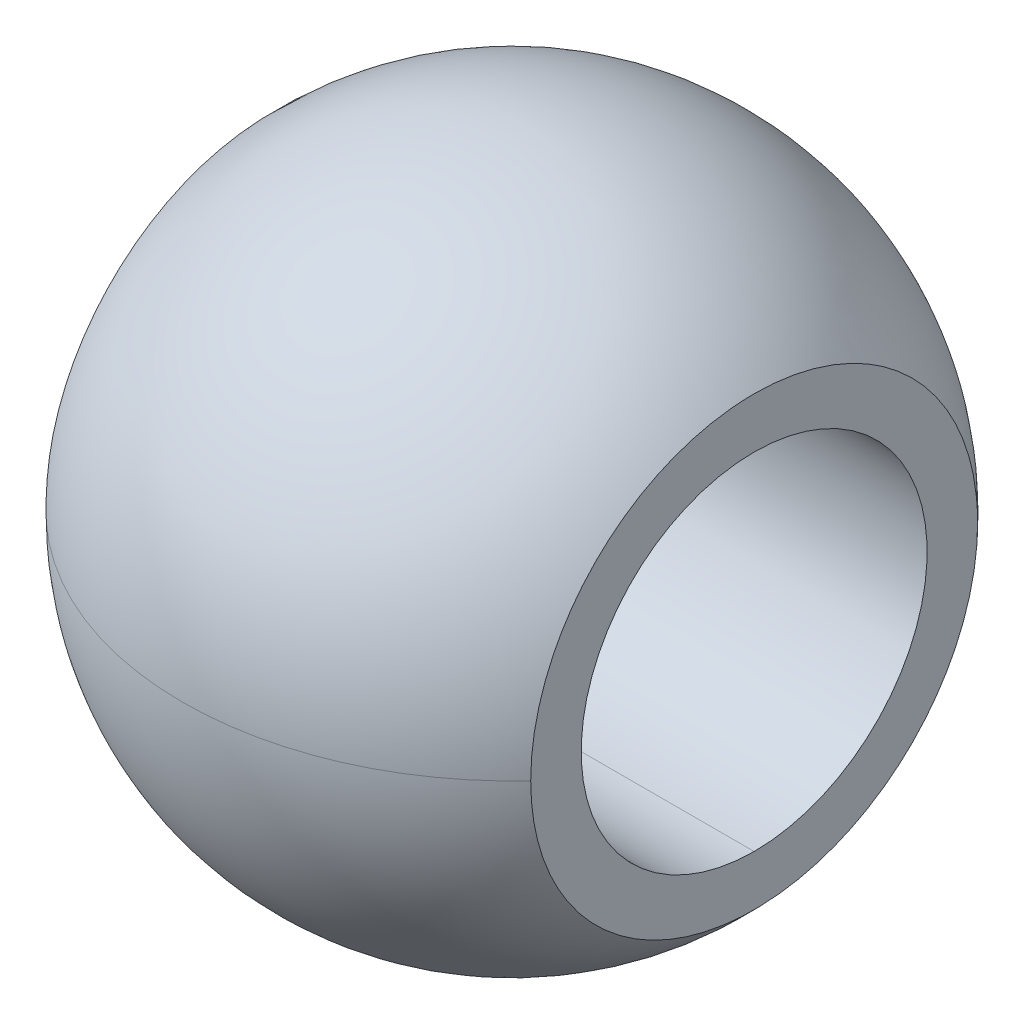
ISO-10303-21;
HEADER;
FILE_DESCRIPTION(('STEP AP214'),'2;1');
FILE_NAME('part.step','',(''),(''),'','','');
FILE_SCHEMA(('AUTOMOTIVE_DESIGN { 1 0 10303 214 1 1 1 1 }'));
ENDSEC;
DATA;
#1=APPLICATION_CONTEXT('core data for automotive mechanical design processes');
#2=APPLICATION_PROTOCOL_DEFINITION('international standard','automotive_design',2000,#1);
#3=PRODUCT_CONTEXT('',#1,'mechanical');
#4=PRODUCT('Part','Part','',(#3));
#5=PRODUCT_RELATED_PRODUCT_CATEGORY('part','',(#4));
#6=PRODUCT_DEFINITION_FORMATION('','',#4);
#7=PRODUCT_DEFINITION_CONTEXT('part definition',#1,'design');
#8=PRODUCT_DEFINITION('design','',#6,#7);
#9=PRODUCT_DEFINITION_SHAPE('','',#8);
#10=(LENGTH_UNIT() NAMED_UNIT(*) SI_UNIT(.MILLI.,.METRE.));
#11=(NAMED_UNIT(*) PLANE_ANGLE_UNIT() SI_UNIT($,.RADIAN.));
#12=(NAMED_UNIT(*) SI_UNIT($,.STERADIAN.) SOLID_ANGLE_UNIT());
#13=UNCERTAINTY_MEASURE_WITH_UNIT(LENGTH_MEASURE(1.E-05),#10,'distance_accuracy_value','');
#14=(GEOMETRIC_REPRESENTATION_CONTEXT(3) GLOBAL_UNCERTAINTY_ASSIGNED_CONTEXT((#13)) GLOBAL_UNIT_ASSIGNED_CONTEXT((#10,
#11,#12)) REPRESENTATION_CONTEXT('',''));
#15=CARTESIAN_POINT('',(0.,0.,0.));
#16=DIRECTION('',(0.,0.,1.));
#17=DIRECTION('',(1.,0.,0.));
#18=AXIS2_PLACEMENT_3D('',#15,#16,#17);
#19=CARTESIAN_POINT('',(0.,0.,0.));
#20=DIRECTION('',(-1.,0.,0.));
#21=DIRECTION('',(0.,0.,1.));
#22=AXIS2_PLACEMENT_3D('',#19,#20,#21);
#23=CYLINDRICAL_SURFACE('',#22,5.);
#24=CARTESIAN_POINT('',(-7.,0.,0.));
#25=DIRECTION('',(-1.,0.,0.));
#26=DIRECTION('',(0.,0.,1.));
#27=AXIS2_PLACEMENT_3D('',#24,#25,#26);
#28=CIRCLE('',#27,5.);
#29=CARTESIAN_POINT('',(-7.,5.,0.));
#30=VERTEX_POINT('',#29);
#31=CARTESIAN_POINT('',(-7.,-5.,0.));
#32=VERTEX_POINT('',#31);
#33=EDGE_CURVE('E68',#30,#32,#28,.T.);
#34=ORIENTED_EDGE('',*,*,#33,.T.);
#35=DIRECTION('',(-1.,0.,0.));
#36=VECTOR('',#35,1.);
#37=CARTESIAN_POINT('',(0.,-5.,0.));
#38=LINE('',#37,#36);
#39=CARTESIAN_POINT('',(7.,-5.,0.));
#40=VERTEX_POINT('',#39);
#41=EDGE_CURVE('E63',#32,#40,#38,.F.);
#42=ORIENTED_EDGE('',*,*,#41,.T.);
#43=CARTESIAN_POINT('',(7.,0.,0.));
#44=DIRECTION('',(-1.,0.,0.));
#45=DIRECTION('',(0.,0.,1.));
#46=AXIS2_PLACEMENT_3D('',#43,#44,#45);
#47=CIRCLE('',#46,5.);
#48=CARTESIAN_POINT('',(7.,5.,0.));
#49=VERTEX_POINT('',#48);
#50=EDGE_CURVE('E65',#40,#49,#47,.F.);
#51=ORIENTED_EDGE('',*,*,#50,.T.);
#52=DIRECTION('',(-1.,0.,0.));
#53=VECTOR('',#52,1.);
#54=CARTESIAN_POINT('',(0.,5.,0.));
#55=LINE('',#54,#53);
#56=EDGE_CURVE('E58',#49,#30,#55,.T.);
#57=ORIENTED_EDGE('',*,*,#56,.T.);
#58=EDGE_LOOP('',(#34,#42,#51,#57));
#59=FACE_BOUND('',#58,.T.);
#60=ADVANCED_FACE('F14',(#59),#23,.F.);
#61=CARTESIAN_POINT('',(0.,0.,0.));
#62=DIRECTION('',(-1.,0.,0.));
#63=DIRECTION('',(0.,0.,1.));
#64=AXIS2_PLACEMENT_3D('',#61,#62,#63);
#65=CYLINDRICAL_SURFACE('',#64,5.);
#66=CARTESIAN_POINT('',(7.,0.,0.));
#67=DIRECTION('',(-1.,0.,0.));
#68=DIRECTION('',(0.,0.,1.));
#69=AXIS2_PLACEMENT_3D('',#66,#67,#68);
#70=CIRCLE('',#69,5.);
#71=EDGE_CURVE('E17',#49,#40,#70,.F.);
#72=ORIENTED_EDGE('',*,*,#71,.T.);
#73=ORIENTED_EDGE('',*,*,#41,.F.);
#74=CARTESIAN_POINT('',(-7.,0.,0.));
#75=DIRECTION('',(-1.,0.,0.));
#76=DIRECTION('',(0.,0.,1.));
#77=AXIS2_PLACEMENT_3D('',#74,#75,#76);
#78=CIRCLE('',#77,5.);
#79=EDGE_CURVE('E154',#32,#30,#78,.T.);
#80=ORIENTED_EDGE('',*,*,#79,.T.);
#81=ORIENTED_EDGE('',*,*,#56,.F.);
#82=EDGE_LOOP('',(#72,#73,#80,#81));
#83=FACE_BOUND('',#82,.T.);
#84=ADVANCED_FACE('F71',(#83),#65,.F.);
#85=CARTESIAN_POINT('',(7.,19.05,-19.05));
#86=DIRECTION('',(-1.,0.,0.));
#87=DIRECTION('',(0.,0.,1.));
#88=AXIS2_PLACEMENT_3D('',#85,#86,#87);
#89=PLANE('',#88);
#90=CARTESIAN_POINT('',(7.,0.,6.45953752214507));
#91=CARTESIAN_POINT('',(7.,0.181681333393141,6.45955705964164));
#92=CARTESIAN_POINT('',(7.,0.363359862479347,6.45187337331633));
#93=CARTESIAN_POINT('',(7.,0.725417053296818,6.42124065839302));
#94=CARTESIAN_POINT('',(7.,0.905795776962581,6.39829236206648));
#95=CARTESIAN_POINT('',(7.,1.2638414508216,6.33729456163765));
#96=CARTESIAN_POINT('',(7.,1.4415103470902,6.29925648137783));
#97=CARTESIAN_POINT('',(7.,1.79301196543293,6.20835581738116));
#98=CARTESIAN_POINT('',(7.,1.96684473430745,6.15549341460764));
#99=CARTESIAN_POINT('',(7.,2.30949328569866,6.03529955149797));
#100=CARTESIAN_POINT('',(7.,2.47830753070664,5.967963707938));
#101=CARTESIAN_POINT('',(7.,2.80972516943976,5.81928406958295));
#102=CARTESIAN_POINT('',(7.,2.97232625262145,5.73793512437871));
#103=CARTESIAN_POINT('',(7.,3.29003619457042,5.5618576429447));
#104=CARTESIAN_POINT('',(7.,3.44514781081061,5.46713408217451));
#105=CARTESIAN_POINT('',(7.,3.74684404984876,5.26495579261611));
#106=CARTESIAN_POINT('',(7.,3.89342849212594,5.15750079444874));
#107=CARTESIAN_POINT('',(7.,4.1770219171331,4.93062738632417));
#108=CARTESIAN_POINT('',(7.,4.31403109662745,4.81120922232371));
#109=CARTESIAN_POINT('',(7.,4.57750349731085,4.5612564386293));
#110=CARTESIAN_POINT('',(7.,4.70396671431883,4.43072181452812));
#111=CARTESIAN_POINT('',(7.,4.94547314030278,4.1594359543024));
#112=CARTESIAN_POINT('',(7.,5.06051399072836,4.01868261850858));
#113=CARTESIAN_POINT('',(7.,5.27832573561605,3.72798718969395));
#114=CARTESIAN_POINT('',(7.,5.38109688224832,3.57804528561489));
#115=CARTESIAN_POINT('',(7.,5.5736786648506,3.26997579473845));
#116=CARTESIAN_POINT('',(7.,5.66348425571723,3.11184505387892));
#117=CARTESIAN_POINT('',(7.,5.82941796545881,2.78863785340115));
#118=CARTESIAN_POINT('',(7.,5.90555104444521,2.62356393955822));
#119=CARTESIAN_POINT('',(7.,6.04361944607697,2.28762986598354));
#120=CARTESIAN_POINT('',(7.,6.10555881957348,2.11677137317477));
#121=CARTESIAN_POINT('',(7.,6.21481170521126,1.7705117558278));
#122=CARTESIAN_POINT('',(7.,6.26212873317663,1.59511173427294));
#123=CARTESIAN_POINT('',(7.,6.35431328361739,1.18537266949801));
#124=CARTESIAN_POINT('',(7.,6.39377106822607,0.949781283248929));
#125=CARTESIAN_POINT('',(7.,6.43322633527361,0.594502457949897));
#126=CARTESIAN_POINT('',(7.,6.44308951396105,0.475821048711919));
#127=CARTESIAN_POINT('',(7.,6.45624429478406,0.238102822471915));
#128=CARTESIAN_POINT('',(7.,6.45953635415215,0.119066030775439));
#129=CARTESIAN_POINT('',(7.,6.45953752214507,0.));
#130=B_SPLINE_CURVE_WITH_KNOTS('',3,(#90,#91,#92,#93,#94,#95,#96,#97,#98,#99,#100,#101,#102,
#103,#104,#105,#106,#107,#108,#109,#110,#111,#112,#113,#114,#115,#116,#117,#118,#119,#120,#121,
#122,#123,#124,#125,#126,#127,#128,#129),.UNSPECIFIED.,.F.,.F.,(4,2,2,2,2,2,2,2,2,2,2,2,2,2,2,2,
2,2,2,4),(0.,0.544877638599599,1.08972914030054,1.63416894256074,2.17860209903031,
2.72320036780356,3.26799922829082,3.81259595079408,4.35720419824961,4.90180125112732,
5.44639851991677,5.99110800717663,6.53580629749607,7.08071597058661,7.62542756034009,
8.16998349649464,8.71440839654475,9.42936456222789,9.78648365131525,10.1435778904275),.UNSPECIFIED.);
#131=CARTESIAN_POINT('',(7.,0.,6.45953752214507));
#132=VERTEX_POINT('',#131);
#133=CARTESIAN_POINT('',(7.,6.45953752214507,0.));
#134=VERTEX_POINT('',#133);
#135=EDGE_CURVE('E74',#132,#134,#130,.T.);
#136=ORIENTED_EDGE('',*,*,#135,.F.);
#137=CARTESIAN_POINT('',(7.,-1.45949917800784E-12,-6.45953752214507));
#138=CARTESIAN_POINT('',(7.,-0.181676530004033,-6.45955705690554));
#139=CARTESIAN_POINT('',(7.,-0.363350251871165,-6.4518737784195));
#140=CARTESIAN_POINT('',(7.,-0.72539794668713,-6.42124268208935));
#141=CARTESIAN_POINT('',(7.,-0.905771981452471,-6.39829559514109));
#142=CARTESIAN_POINT('',(7.,-1.26381793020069,-6.33729938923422));
#143=CARTESIAN_POINT('',(7.,-1.44149165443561,-6.29926089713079));
#144=CARTESIAN_POINT('',(7.,-1.79300276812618,-6.2083586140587));
#145=CARTESIAN_POINT('',(7.,-1.96684020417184,-6.15549500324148));
#146=CARTESIAN_POINT('',(7.,-2.30949492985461,-6.03529897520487));
#147=CARTESIAN_POINT('',(7.,-2.47831076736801,-5.96796241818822));
#148=CARTESIAN_POINT('',(7.,-2.80973166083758,-5.81928099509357));
#149=CARTESIAN_POINT('',(7.,-2.97233439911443,-5.73793096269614));
#150=CARTESIAN_POINT('',(7.,-3.29001648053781,-5.56186821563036));
#151=CARTESIAN_POINT('',(7.,-3.44510002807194,-5.46716308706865));
#152=CARTESIAN_POINT('',(7.,-3.74679599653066,-5.26499101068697));
#153=CARTESIAN_POINT('',(7.,-3.89340526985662,-5.1575193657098));
#154=CARTESIAN_POINT('',(7.,-4.17699884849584,-4.93064584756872));
#155=CARTESIAN_POINT('',(7.,-4.31398647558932,-4.81124812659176));
#156=CARTESIAN_POINT('',(7.,-4.57746802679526,-4.56129351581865));
#157=CARTESIAN_POINT('',(7.,-4.70395805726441,-4.43073252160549));
#158=CARTESIAN_POINT('',(7.,-4.9454622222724,-4.15944723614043));
#159=CARTESIAN_POINT('',(7.,-5.06047883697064,-4.01872515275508));
#160=CARTESIAN_POINT('',(7.,-5.27829010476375,-3.72803912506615));
#161=CARTESIAN_POINT('',(7.,-5.38108022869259,-3.57807178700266));
#162=CARTESIAN_POINT('',(7.,-5.57361816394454,-3.2700727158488));
#163=CARTESIAN_POINT('',(7.,-5.66337134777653,-3.11204434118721));
#164=CARTESIAN_POINT('',(7.,-5.82927878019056,-2.78892956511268));
#165=CARTESIAN_POINT('',(7.,-5.90542799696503,-2.62384058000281));
#166=CARTESIAN_POINT('',(7.,-6.04351523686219,-2.28790611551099));
#167=CARTESIAN_POINT('',(7.,-6.10545939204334,-2.11706315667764));
#168=CARTESIAN_POINT('',(7.,-6.21475863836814,-1.77070325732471));
#169=CARTESIAN_POINT('',(7.,-6.26210835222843,-1.5951846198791));
#170=CARTESIAN_POINT('',(7.,-6.34184412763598,-1.2408128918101));
#171=CARTESIAN_POINT('',(7.,-6.37423279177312,-1.06196038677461));
#172=CARTESIAN_POINT('',(7.,-6.42382891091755,-0.702158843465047));
#173=CARTESIAN_POINT('',(7.,-6.44103604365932,-0.52120976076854));
#174=CARTESIAN_POINT('',(7.,-6.46014570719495,-0.158502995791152));
#175=CARTESIAN_POINT('',(7.,-6.46204804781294,0.0232546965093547));
#176=CARTESIAN_POINT('',(7.,-6.45053410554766,0.38628423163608));
#177=CARTESIAN_POINT('',(7.,-6.4371178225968,0.567556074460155));
#178=CARTESIAN_POINT('',(7.,-6.39506199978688,0.928325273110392));
#179=CARTESIAN_POINT('',(7.,-6.36642244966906,1.10782262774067));
#180=CARTESIAN_POINT('',(7.,-6.29412447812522,1.46376277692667));
#181=CARTESIAN_POINT('',(7.,-6.25046637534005,1.64020563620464));
#182=CARTESIAN_POINT('',(7.,-6.14843174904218,1.98881975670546));
#183=CARTESIAN_POINT('',(7.,-6.09005240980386,2.16099019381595));
#184=CARTESIAN_POINT('',(7.,-5.95901881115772,2.49973750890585));
#185=CARTESIAN_POINT('',(7.,-5.88636981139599,2.66631642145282));
#186=CARTESIAN_POINT('',(7.,-5.72726810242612,2.99282789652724));
#187=CARTESIAN_POINT('',(7.,-5.64080995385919,3.15275780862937));
#188=CARTESIAN_POINT('',(7.,-5.45475984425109,3.46470627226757));
#189=CARTESIAN_POINT('',(7.,-5.35517274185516,3.61672772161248));
#190=CARTESIAN_POINT('',(7.,-5.14351391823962,3.9118895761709));
#191=CARTESIAN_POINT('',(7.,-5.03143821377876,4.05502712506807));
#192=CARTESIAN_POINT('',(7.,-4.79566876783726,4.33129914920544));
#193=CARTESIAN_POINT('',(7.,-4.67197933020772,4.46443729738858));
#194=CARTESIAN_POINT('',(7.,-4.41379607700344,4.71985283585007));
#195=CARTESIAN_POINT('',(7.,-4.2792997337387,4.84212767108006));
#196=CARTESIAN_POINT('',(7.,-4.00053572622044,5.07486909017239));
#197=CARTESIAN_POINT('',(7.,-3.85627168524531,5.18534001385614));
#198=CARTESIAN_POINT('',(7.,-3.55885055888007,5.39381222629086));
#199=CARTESIAN_POINT('',(7.,-3.40568742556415,5.49180488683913));
#200=CARTESIAN_POINT('',(7.,-3.09170603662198,5.67450059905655));
#201=CARTESIAN_POINT('',(7.,-2.93089062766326,5.75920854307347));
#202=CARTESIAN_POINT('',(7.,-2.60253464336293,5.9148526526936));
#203=CARTESIAN_POINT('',(7.,-2.4349876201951,5.98577521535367));
#204=CARTESIAN_POINT('',(7.,-2.09457273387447,6.11321577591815));
#205=CARTESIAN_POINT('',(7.,-1.92170689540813,6.16973918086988));
#206=CARTESIAN_POINT('',(7.,-1.57202362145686,6.26795944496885));
#207=CARTESIAN_POINT('',(7.,-1.39521074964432,6.30967257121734));
#208=CARTESIAN_POINT('',(7.,-1.03877074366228,6.37804724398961));
#209=CARTESIAN_POINT('',(7.,-0.85914503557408,6.4047161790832));
#210=CARTESIAN_POINT('',(7.,-0.565940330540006,6.43569822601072));
#211=CARTESIAN_POINT('',(7.,-0.452830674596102,6.44464366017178));
#212=CARTESIAN_POINT('',(7.,-0.22648460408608,6.45655902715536));
#213=CARTESIAN_POINT('',(7.,-0.113248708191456,6.45953881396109));
#214=CARTESIAN_POINT('',(7.,0.,6.45953752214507));
#215=B_SPLINE_CURVE_WITH_KNOTS('',3,(#137,#138,#139,#140,#141,#142,#143,#144,#145,#146,#147,
#148,#149,#150,#151,#152,#153,#154,#155,#156,#157,#158,#159,#160,#161,#162,#163,#164,#165,#166,
#167,#168,#169,#170,#171,#172,#173,#174,#175,#176,#177,#178,#179,#180,#181,#182,#183,#184,#185,
#186,#187,#188,#189,#190,#191,#192,#193,#194,#195,#196,#197,#198,#199,#200,#201,#202,#203,#204,
#205,#206,#207,#208,#209,#210,#211,#212,#213,#214),.UNSPECIFIED.,.F.,.F.,(4,2,2,2,2,2,2,2,2,2,2,
2,2,2,2,2,2,2,2,2,2,2,2,2,2,2,2,2,2,2,2,2,2,2,2,2,2,2,4),(0.,0.544863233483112,1.08970037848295,
1.63415454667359,2.17860209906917,2.72320559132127,3.26801029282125,3.81250676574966,
4.35720419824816,4.90171264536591,5.44642216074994,5.99101367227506,6.53580629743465,
7.08037377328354,7.62514225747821,8.16967513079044,8.71440839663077,9.25904686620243,
9.80369689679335,10.3483536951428,10.8930104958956,11.4376676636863,11.9823132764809,
12.5270631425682,13.0716125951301,13.6163770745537,14.1609405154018,14.7056781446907,
15.2502146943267,15.7948789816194,16.3393423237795,16.8841801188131,17.4288167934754,
17.9739881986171,18.518954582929,19.0633205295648,19.6074188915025,19.9476628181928,
20.2873442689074),.UNSPECIFIED.);
#216=CARTESIAN_POINT('',(7.,-1.45975822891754E-12,-6.45953752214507));
#217=VERTEX_POINT('',#216);
#218=EDGE_CURVE('E151',#217,#132,#215,.T.);
#219=ORIENTED_EDGE('',*,*,#218,.F.);
#220=CARTESIAN_POINT('',(7.,6.45953752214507,0.));
#221=CARTESIAN_POINT('',(7.,6.45955705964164,-0.181681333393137));
#222=CARTESIAN_POINT('',(7.,6.45187337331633,-0.363359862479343));
#223=CARTESIAN_POINT('',(7.,6.42124065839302,-0.725417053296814));
#224=CARTESIAN_POINT('',(7.,6.39829236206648,-0.905795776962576));
#225=CARTESIAN_POINT('',(7.,6.33729456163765,-1.26384145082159));
#226=CARTESIAN_POINT('',(7.,6.29925648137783,-1.4415103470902));
#227=CARTESIAN_POINT('',(7.,6.20835581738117,-1.79301196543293));
#228=CARTESIAN_POINT('',(7.,6.15549341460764,-1.96684473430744));
#229=CARTESIAN_POINT('',(7.,6.03529955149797,-2.30949328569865));
#230=CARTESIAN_POINT('',(7.,5.96796370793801,-2.47830753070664));
#231=CARTESIAN_POINT('',(7.,5.81928406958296,-2.80972516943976));
#232=CARTESIAN_POINT('',(7.,5.73793512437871,-2.97232625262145));
#233=CARTESIAN_POINT('',(7.,5.56185764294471,-3.29003619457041));
#234=CARTESIAN_POINT('',(7.,5.46713408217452,-3.4451478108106));
#235=CARTESIAN_POINT('',(7.,5.26495579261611,-3.74684404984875));
#236=CARTESIAN_POINT('',(7.,5.15750079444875,-3.89342849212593));
#237=CARTESIAN_POINT('',(7.,4.93062738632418,-4.17702191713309));
#238=CARTESIAN_POINT('',(7.,4.81120922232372,-4.31403109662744));
#239=CARTESIAN_POINT('',(7.,4.5612564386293,-4.57750349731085));
#240=CARTESIAN_POINT('',(7.,4.43072181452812,-4.70396671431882));
#241=CARTESIAN_POINT('',(7.,4.15943595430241,-4.94547314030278));
#242=CARTESIAN_POINT('',(7.,4.01868261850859,-5.06051399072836));
#243=CARTESIAN_POINT('',(7.,3.72798718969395,-5.27832573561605));
#244=CARTESIAN_POINT('',(7.,3.57804528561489,-5.38109688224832));
#245=CARTESIAN_POINT('',(7.,3.26997579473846,-5.5736786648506));
#246=CARTESIAN_POINT('',(7.,3.11184505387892,-5.66348425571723));
#247=CARTESIAN_POINT('',(7.,2.78863785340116,-5.82941796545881));
#248=CARTESIAN_POINT('',(7.,2.62356393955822,-5.90555104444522));
#249=CARTESIAN_POINT('',(7.,2.28762986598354,-6.04361944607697));
#250=CARTESIAN_POINT('',(7.,2.11677137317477,-6.10555881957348));
#251=CARTESIAN_POINT('',(7.,1.7705117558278,-6.21481170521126));
#252=CARTESIAN_POINT('',(7.,1.59511173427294,-6.26212873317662));
#253=CARTESIAN_POINT('',(7.,1.18537266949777,-6.35431328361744));
#254=CARTESIAN_POINT('',(7.,0.949781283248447,-6.39377106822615));
#255=CARTESIAN_POINT('',(7.,0.594502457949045,-6.43322633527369));
#256=CARTESIAN_POINT('',(7.,0.475821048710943,-6.44308951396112));
#257=CARTESIAN_POINT('',(7.,0.238102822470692,-6.45624429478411));
#258=CARTESIAN_POINT('',(7.,0.119066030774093,-6.45953635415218));
#259=CARTESIAN_POINT('',(7.,-1.4688250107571E-12,-6.45953752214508));
#260=B_SPLINE_CURVE_WITH_KNOTS('',3,(#220,#221,#222,#223,#224,#225,#226,#227,#228,#229,#230,
#231,#232,#233,#234,#235,#236,#237,#238,#239,#240,#241,#242,#243,#244,#245,#246,#247,#248,#249,
#250,#251,#252,#253,#254,#255,#256,#257,#258,#259),.UNSPECIFIED.,.F.,.F.,(4,2,2,2,2,2,2,2,2,2,2,
2,2,2,2,2,2,2,2,4),(0.,0.544877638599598,1.08972914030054,1.63416894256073,2.17860209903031,
2.72320036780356,3.26799922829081,3.81259595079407,4.35720419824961,4.90180125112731,
5.44639851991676,5.99110800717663,6.53580629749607,7.08071597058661,7.62542756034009,
8.16998349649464,8.71440839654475,9.42936456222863,9.78648365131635,10.143577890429),.UNSPECIFIED.);
#261=EDGE_CURVE('E76',#134,#217,#260,.T.);
#262=ORIENTED_EDGE('',*,*,#261,.F.);
#263=EDGE_LOOP('',(#136,#219,#262));
#264=FACE_BOUND('',#263,.T.);
#265=ORIENTED_EDGE('',*,*,#71,.F.);
#266=ORIENTED_EDGE('',*,*,#50,.F.);
#267=EDGE_LOOP('',(#265,#266));
#268=FACE_BOUND('',#267,.T.);
#269=ADVANCED_FACE('F73',(#264,#268),#89,.F.);
#270=CARTESIAN_POINT('',(0.,0.,0.));
#271=DIRECTION('',(0.,0.,-1.));
#272=DIRECTION('',(0.,1.,0.));
#273=AXIS2_PLACEMENT_3D('',#270,#271,#272);
#274=SPHERICAL_SURFACE('',#273,9.525);
#275=ORIENTED_EDGE('',*,*,#135,.T.);
#276=ORIENTED_EDGE('',*,*,#261,.T.);
#277=CARTESIAN_POINT('',(0.,0.,-9.525));
#278=CARTESIAN_POINT('',(0.163816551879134,-2.04487866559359E-13,-9.52500403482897));
#279=CARTESIAN_POINT('',(0.327632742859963,-4.08975282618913E-13,-9.52077403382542));
#280=CARTESIAN_POINT('',(0.654829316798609,-8.17406107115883E-13,-9.5038749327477));
#281=CARTESIAN_POINT('',(0.818209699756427,-1.0213495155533E-12,-9.49120583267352));
#282=CARTESIAN_POINT('',(1.14409957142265,-1.42814921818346E-12,-9.45745750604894));
#283=CARTESIAN_POINT('',(1.30660906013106,-1.6310055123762E-12,-9.43637827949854));
#284=CARTESIAN_POINT('',(1.63032468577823,-2.03509116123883E-12,-9.3858670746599));
#285=CARTESIAN_POINT('',(1.791530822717,-2.23632051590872E-12,-9.35643509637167));
#286=CARTESIAN_POINT('',(2.1122106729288,-2.63661668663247E-12,-9.28929638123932));
#287=CARTESIAN_POINT('',(2.27168438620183,-2.83568350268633E-12,-9.25158964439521));
#288=CARTESIAN_POINT('',(2.58847495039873,-3.23112478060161E-12,-9.16800186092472));
#289=CARTESIAN_POINT('',(2.7457918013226,-3.42749924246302E-12,-9.12212081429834));
#290=CARTESIAN_POINT('',(3.05784993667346,-3.81703315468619E-12,-9.02230650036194));
#291=CARTESIAN_POINT('',(3.21259122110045,-4.01019260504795E-12,-8.96837323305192));
#292=CARTESIAN_POINT('',(3.51908637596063,-4.39278239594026E-12,-8.85259802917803));
#293=CARTESIAN_POINT('',(3.67084024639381,-4.58221273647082E-12,-8.79075609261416));
#294=CARTESIAN_POINT('',(3.97095667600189,-4.95684013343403E-12,-8.65932814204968));
#295=CARTESIAN_POINT('',(4.1193192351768,-5.14203718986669E-12,-8.58974212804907));
#296=CARTESIAN_POINT('',(4.41225817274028,-5.50770511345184E-12,-8.44301122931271));
#297=CARTESIAN_POINT('',(4.55683455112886,-5.68817598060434E-12,-8.36586634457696));
#298=CARTESIAN_POINT('',(4.84181632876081,-6.04391119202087E-12,-8.20422302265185));
#299=CARTESIAN_POINT('',(4.98222172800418,-6.2191755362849E-12,-8.11972458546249));
#300=CARTESIAN_POINT('',(5.2584878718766,-6.56403125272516E-12,-7.94359907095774));
#301=CARTESIAN_POINT('',(5.39434861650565,-6.73362262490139E-12,-7.85197199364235));
#302=CARTESIAN_POINT('',(5.66116379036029,-7.06668094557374E-12,-7.66183300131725));
#303=CARTESIAN_POINT('',(5.79211821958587,-7.23014789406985E-12,-7.56332108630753));
#304=CARTESIAN_POINT('',(6.04877246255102,-7.55052259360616E-12,-7.35967485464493));
#305=CARTESIAN_POINT('',(6.17447227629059,-7.70743034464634E-12,-7.25454053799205));
#306=CARTESIAN_POINT('',(6.42028184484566,-8.01426792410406E-12,-7.03792840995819));
#307=CARTESIAN_POINT('',(6.54039159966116,-8.16419775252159E-12,-6.92645059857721));
#308=CARTESIAN_POINT('',(6.77470469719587,-8.45668459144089E-12,-6.69745158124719));
#309=CARTESIAN_POINT('',(6.88890803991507,-8.59924160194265E-12,-6.57993037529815));
#310=CARTESIAN_POINT('',(7.,-8.73791475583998E-12,-6.45953752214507));
#311=B_SPLINE_CURVE_WITH_KNOTS('',3,(#277,#278,#279,#280,#281,#282,#283,#284,#285,#286,#287,
#288,#289,#290,#291,#292,#293,#294,#295,#296,#297,#298,#299,#300,#301,#302,#303,#304,#305,#306,
#307,#308,#309,#310),.UNSPECIFIED.,.F.,.F.,(4,2,2,2,2,2,2,2,2,2,2,2,2,2,2,2,4),(0.,
0.491394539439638,0.982789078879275,1.47418361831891,1.96557815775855,2.45697269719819,
2.94836723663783,3.43976177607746,3.9311563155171,4.42255085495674,4.91394539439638,
5.40533993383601,5.89673447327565,6.38812901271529,6.87952355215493,7.37091809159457,
7.8623126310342),.UNSPECIFIED.);
#312=CARTESIAN_POINT('',(0.,0.,-9.525));
#313=VERTEX_POINT('',#312);
#314=EDGE_CURVE('E145',#313,#217,#311,.T.);
#315=ORIENTED_EDGE('',*,*,#314,.F.);
#316=CARTESIAN_POINT('',(0.,0.,0.));
#317=DIRECTION('',(-1.25073890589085E-12,1.,0.));
#318=DIRECTION('',(0.,0.,-1.));
#319=AXIS2_PLACEMENT_3D('',#316,#317,#318);
#320=CIRCLE('',#319,9.525);
#321=CARTESIAN_POINT('',(-7.,-5.1088900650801E-12,-6.45953752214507));
#322=VERTEX_POINT('',#321);
#323=EDGE_CURVE('E147',#322,#313,#320,.F.);
#324=ORIENTED_EDGE('',*,*,#323,.F.);
#325=CARTESIAN_POINT('',(-7.,-1.46260778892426E-12,-6.45953752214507));
#326=CARTESIAN_POINT('',(-7.,0.18167653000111,-6.45955705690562));
#327=CARTESIAN_POINT('',(-7.,0.363350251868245,-6.45187377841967));
#328=CARTESIAN_POINT('',(-7.,0.725397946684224,-6.42124268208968));
#329=CARTESIAN_POINT('',(-7.,0.905771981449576,-6.3982955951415));
#330=CARTESIAN_POINT('',(-7.,1.26381793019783,-6.33729938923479));
#331=CARTESIAN_POINT('',(-7.,1.44149165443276,-6.29926089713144));
#332=CARTESIAN_POINT('',(-7.,1.79300276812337,-6.20835861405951));
#333=CARTESIAN_POINT('',(-7.,1.96684020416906,-6.15549500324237));
#334=CARTESIAN_POINT('',(-7.,2.30949492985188,-6.03529897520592));
#335=CARTESIAN_POINT('',(-7.,2.47831076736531,-5.96796241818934));
#336=CARTESIAN_POINT('',(-7.,2.80973166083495,-5.81928099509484));
#337=CARTESIAN_POINT('',(-7.,2.97233439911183,-5.73793096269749));
#338=CARTESIAN_POINT('',(-7.,3.29001648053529,-5.56186821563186));
#339=CARTESIAN_POINT('',(-7.,3.44510002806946,-5.46716308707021));
#340=CARTESIAN_POINT('',(-7.,3.74679599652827,-5.26499101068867));
#341=CARTESIAN_POINT('',(-7.,3.89340526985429,-5.15751936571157));
#342=CARTESIAN_POINT('',(-7.,4.17699884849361,-4.93064584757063));
#343=CARTESIAN_POINT('',(-7.,4.31398647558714,-4.81124812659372));
#344=CARTESIAN_POINT('',(-7.,4.57746802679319,-4.56129351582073));
#345=CARTESIAN_POINT('',(-7.,4.7039580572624,-4.43073252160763));
#346=CARTESIAN_POINT('',(-7.,4.94546222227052,-4.15944723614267));
#347=CARTESIAN_POINT('',(-7.,5.06047883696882,-4.01872515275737));
#348=CARTESIAN_POINT('',(-7.,5.27829010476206,-3.72803912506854));
#349=CARTESIAN_POINT('',(-7.,5.38108022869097,-3.5780717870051));
#350=CARTESIAN_POINT('',(-7.,5.57361816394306,-3.27007271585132));
#351=CARTESIAN_POINT('',(-7.,5.66337134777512,-3.11204434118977));
#352=CARTESIAN_POINT('',(-7.,5.8292787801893,-2.78892956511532));
#353=CARTESIAN_POINT('',(-7.,5.90542799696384,-2.62384058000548));
#354=CARTESIAN_POINT('',(-7.,6.04351523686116,-2.28790611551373));
#355=CARTESIAN_POINT('',(-7.,6.10545939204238,-2.1170631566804));
#356=CARTESIAN_POINT('',(-7.,6.21475863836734,-1.77070325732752));
#357=CARTESIAN_POINT('',(-7.,6.26210835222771,-1.59518461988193));
#358=CARTESIAN_POINT('',(-7.,6.34184412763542,-1.24081289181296));
#359=CARTESIAN_POINT('',(-7.,6.37423279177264,-1.06196038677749));
#360=CARTESIAN_POINT('',(-7.,6.42382891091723,-0.702158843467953));
#361=CARTESIAN_POINT('',(-7.,6.44103604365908,-0.521209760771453));
#362=CARTESIAN_POINT('',(-7.,6.46014570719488,-0.158502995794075));
#363=CARTESIAN_POINT('',(-7.,6.46204804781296,0.0232546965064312));
#364=CARTESIAN_POINT('',(-7.,6.45053410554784,0.386284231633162));
#365=CARTESIAN_POINT('',(-7.,6.43711782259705,0.567556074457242));
#366=CARTESIAN_POINT('',(-7.,6.39506199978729,0.928325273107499));
#367=CARTESIAN_POINT('',(-7.,6.36642244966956,1.10782262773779));
#368=CARTESIAN_POINT('',(-7.,6.29412447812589,1.46376277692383));
#369=CARTESIAN_POINT('',(-7.,6.25046637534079,1.64020563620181));
#370=CARTESIAN_POINT('',(-7.,6.14843174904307,1.98881975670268));
#371=CARTESIAN_POINT('',(-7.,6.09005240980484,2.1609901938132));
#372=CARTESIAN_POINT('',(-7.,5.95901881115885,2.49973750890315));
#373=CARTESIAN_POINT('',(-7.,5.8863698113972,2.66631642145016));
#374=CARTESIAN_POINT('',(-7.,5.72726810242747,2.99282789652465));
#375=CARTESIAN_POINT('',(-7.,5.64080995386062,3.15275780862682));
#376=CARTESIAN_POINT('',(-7.,5.45475984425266,3.4647062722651));
#377=CARTESIAN_POINT('',(-7.,5.3551727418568,3.61672772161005));
#378=CARTESIAN_POINT('',(-7.,5.14351391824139,3.91188957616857));
#379=CARTESIAN_POINT('',(-7.,5.0314382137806,4.05502712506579));
#380=CARTESIAN_POINT('',(-7.,4.79566876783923,4.33129914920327));
#381=CARTESIAN_POINT('',(-7.,4.67197933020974,4.46443729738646));
#382=CARTESIAN_POINT('',(-7.,4.41379607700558,4.71985283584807));
#383=CARTESIAN_POINT('',(-7.,4.27929973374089,4.84212767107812));
#384=CARTESIAN_POINT('',(-7.,4.00053572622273,5.07486909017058));
#385=CARTESIAN_POINT('',(-7.,3.85627168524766,5.1853400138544));
#386=CARTESIAN_POINT('',(-7.,3.55885055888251,5.39381222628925));
#387=CARTESIAN_POINT('',(-7.,3.40568742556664,5.49180488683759));
#388=CARTESIAN_POINT('',(-7.,3.09170603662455,5.67450059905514));
#389=CARTESIAN_POINT('',(-7.,2.93089062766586,5.75920854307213));
#390=CARTESIAN_POINT('',(-7.,2.6025346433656,5.91485265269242));
#391=CARTESIAN_POINT('',(-7.,2.43498762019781,5.98577521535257));
#392=CARTESIAN_POINT('',(-7.,2.09457273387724,6.11321577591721));
#393=CARTESIAN_POINT('',(-7.,1.92170689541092,6.16973918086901));
#394=CARTESIAN_POINT('',(-7.,1.57202362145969,6.26795944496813));
#395=CARTESIAN_POINT('',(-7.,1.39521074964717,6.30967257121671));
#396=CARTESIAN_POINT('',(-7.,1.03877074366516,6.37804724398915));
#397=CARTESIAN_POINT('',(-7.,0.859145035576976,6.40471617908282));
#398=CARTESIAN_POINT('',(-7.,0.565940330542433,6.43569822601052));
#399=CARTESIAN_POINT('',(-7.,0.452830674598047,6.44464366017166));
#400=CARTESIAN_POINT('',(-7.,0.226484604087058,6.45655902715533));
#401=CARTESIAN_POINT('',(-7.,0.113248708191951,6.45953881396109));
#402=CARTESIAN_POINT('',(-7.,0.,6.45953752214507));
#403=B_SPLINE_CURVE_WITH_KNOTS('',3,(#325,#326,#327,#328,#329,#330,#331,#332,#333,#334,#335,
#336,#337,#338,#339,#340,#341,#342,#343,#344,#345,#346,#347,#348,#349,#350,#351,#352,#353,#354,
#355,#356,#357,#358,#359,#360,#361,#362,#363,#364,#365,#366,#367,#368,#369,#370,#371,#372,#373,
#374,#375,#376,#377,#378,#379,#380,#381,#382,#383,#384,#385,#386,#387,#388,#389,#390,#391,#392,
#393,#394,#395,#396,#397,#398,#399,#400,#401,#402),.UNSPECIFIED.,.F.,.F.,(4,2,2,2,2,2,2,2,2,2,2,
2,2,2,2,2,2,2,2,2,2,2,2,2,2,2,2,2,2,2,2,2,2,2,2,2,2,2,4),(0.,0.544863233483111,1.08970037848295,
1.63415454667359,2.17860209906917,2.72320559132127,3.26801029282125,3.81250676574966,
4.35720419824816,4.9017126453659,5.44642216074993,5.99101367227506,6.53580629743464,
7.08037377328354,7.62514225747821,8.16967513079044,8.71440839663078,9.25904686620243,
9.80369689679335,10.3483536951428,10.8930104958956,11.4376676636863,11.9823132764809,
12.5270631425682,13.0716125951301,13.6163770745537,14.1609405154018,14.7056781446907,
15.2502146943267,15.7948789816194,16.3393423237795,16.8841801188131,17.4288167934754,
17.9739881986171,18.518954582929,19.0633205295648,19.6074188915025,19.9476628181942,
20.2873442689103),.UNSPECIFIED.);
#404=CARTESIAN_POINT('',(-7.,0.,6.45953752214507));
#405=VERTEX_POINT('',#404);
#406=EDGE_CURVE('E152',#322,#405,#403,.T.);
#407=ORIENTED_EDGE('',*,*,#406,.T.);
#408=CARTESIAN_POINT('',(0.,0.,9.525));
#409=CARTESIAN_POINT('',(-0.163816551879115,0.,9.52500403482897));
#410=CARTESIAN_POINT('',(-0.327632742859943,0.,9.52077403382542));
#411=CARTESIAN_POINT('',(-0.654829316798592,0.,9.5038749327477));
#412=CARTESIAN_POINT('',(-0.818209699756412,0.,9.49120583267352));
#413=CARTESIAN_POINT('',(-1.14409957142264,0.,9.45745750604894));
#414=CARTESIAN_POINT('',(-1.30660906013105,0.,9.43637827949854));
#415=CARTESIAN_POINT('',(-1.63032468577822,0.,9.38586707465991));
#416=CARTESIAN_POINT('',(-1.79153082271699,0.,9.35643509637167));
#417=CARTESIAN_POINT('',(-2.11221067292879,0.,9.28929638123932));
#418=CARTESIAN_POINT('',(-2.27168438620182,0.,9.25158964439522));
#419=CARTESIAN_POINT('',(-2.58847495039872,0.,9.16800186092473));
#420=CARTESIAN_POINT('',(-2.74579180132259,0.,9.12212081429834));
#421=CARTESIAN_POINT('',(-3.05784993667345,0.,9.02230650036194));
#422=CARTESIAN_POINT('',(-3.21259122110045,0.,8.96837323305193));
#423=CARTESIAN_POINT('',(-3.51908637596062,0.,8.85259802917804));
#424=CARTESIAN_POINT('',(-3.67084024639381,0.,8.79075609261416));
#425=CARTESIAN_POINT('',(-3.97095667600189,0.,8.65932814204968));
#426=CARTESIAN_POINT('',(-4.1193192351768,0.,8.58974212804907));
#427=CARTESIAN_POINT('',(-4.41225817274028,0.,8.44301122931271));
#428=CARTESIAN_POINT('',(-4.55683455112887,0.,8.36586634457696));
#429=CARTESIAN_POINT('',(-4.84181632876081,0.,8.20422302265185));
#430=CARTESIAN_POINT('',(-4.98222172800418,0.,8.11972458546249));
#431=CARTESIAN_POINT('',(-5.2584878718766,0.,7.94359907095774));
#432=CARTESIAN_POINT('',(-5.39434861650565,0.,7.85197199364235));
#433=CARTESIAN_POINT('',(-5.66116379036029,0.,7.66183300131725));
#434=CARTESIAN_POINT('',(-5.79211821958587,0.,7.56332108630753));
#435=CARTESIAN_POINT('',(-6.04877246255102,0.,7.35967485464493));
#436=CARTESIAN_POINT('',(-6.17447227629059,0.,7.25454053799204));
#437=CARTESIAN_POINT('',(-6.42028184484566,0.,7.03792840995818));
#438=CARTESIAN_POINT('',(-6.54039159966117,0.,6.92645059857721));
#439=CARTESIAN_POINT('',(-6.77470469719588,0.,6.69745158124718));
#440=CARTESIAN_POINT('',(-6.88890803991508,0.,6.57993037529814));
#441=CARTESIAN_POINT('',(-7.,0.,6.45953752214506));
#442=B_SPLINE_CURVE_WITH_KNOTS('',3,(#408,#409,#410,#411,#412,#413,#414,#415,#416,#417,#418,
#419,#420,#421,#422,#423,#424,#425,#426,#427,#428,#429,#430,#431,#432,#433,#434,#435,#436,#437,
#438,#439,#440,#441),.UNSPECIFIED.,.F.,.F.,(4,2,2,2,2,2,2,2,2,2,2,2,2,2,2,2,4),(0.,
0.491394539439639,0.982789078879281,1.47418361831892,1.96557815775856,2.4569726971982,
2.94836723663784,3.43976177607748,3.93115631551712,4.42255085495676,4.9139453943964,
5.40533993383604,5.89673447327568,6.38812901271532,6.87952355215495,7.3709180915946,
7.86231263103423),.UNSPECIFIED.);
#443=CARTESIAN_POINT('',(0.,0.,9.525));
#444=VERTEX_POINT('',#443);
#445=EDGE_CURVE('E113',#444,#405,#442,.T.);
#446=ORIENTED_EDGE('',*,*,#445,.F.);
#447=CARTESIAN_POINT('',(0.,0.,0.));
#448=DIRECTION('',(0.,-1.,0.));
#449=DIRECTION('',(0.,0.,-1.));
#450=AXIS2_PLACEMENT_3D('',#447,#448,#449);
#451=CIRCLE('',#450,9.525);
#452=EDGE_CURVE('E179',#132,#444,#451,.T.);
#453=ORIENTED_EDGE('',*,*,#452,.F.);
#454=EDGE_LOOP('',(#275,#276,#315,#324,#407,#446,#453));
#455=FACE_BOUND('',#454,.T.);
#456=ADVANCED_FACE('F92',(#455),#274,.T.);
#457=CARTESIAN_POINT('',(-7.,19.05,19.05));
#458=DIRECTION('',(1.,0.,0.));
#459=DIRECTION('',(0.,0.,-1.));
#460=AXIS2_PLACEMENT_3D('',#457,#458,#459);
#461=PLANE('',#460);
#462=CARTESIAN_POINT('',(-7.,0.,6.45953752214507));
#463=CARTESIAN_POINT('',(-7.,-0.181681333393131,6.45955705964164));
#464=CARTESIAN_POINT('',(-7.,-0.363359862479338,6.45187337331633));
#465=CARTESIAN_POINT('',(-7.,-0.725417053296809,6.42124065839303));
#466=CARTESIAN_POINT('',(-7.,-0.905795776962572,6.39829236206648));
#467=CARTESIAN_POINT('',(-7.,-1.26384145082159,6.33729456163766));
#468=CARTESIAN_POINT('',(-7.,-1.44151034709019,6.29925648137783));
#469=CARTESIAN_POINT('',(-7.,-1.79301196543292,6.20835581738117));
#470=CARTESIAN_POINT('',(-7.,-1.96684473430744,6.15549341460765));
#471=CARTESIAN_POINT('',(-7.,-2.30949328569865,6.03529955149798));
#472=CARTESIAN_POINT('',(-7.,-2.47830753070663,5.96796370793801));
#473=CARTESIAN_POINT('',(-7.,-2.80972516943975,5.81928406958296));
#474=CARTESIAN_POINT('',(-7.,-2.97232625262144,5.73793512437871));
#475=CARTESIAN_POINT('',(-7.,-3.29003619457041,5.56185764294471));
#476=CARTESIAN_POINT('',(-7.,-3.4451478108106,5.46713408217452));
#477=CARTESIAN_POINT('',(-7.,-3.74684404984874,5.26495579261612));
#478=CARTESIAN_POINT('',(-7.,-3.89342849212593,5.15750079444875));
#479=CARTESIAN_POINT('',(-7.,-4.17702191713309,4.93062738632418));
#480=CARTESIAN_POINT('',(-7.,-4.31403109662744,4.81120922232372));
#481=CARTESIAN_POINT('',(-7.,-4.57750349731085,4.56125643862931));
#482=CARTESIAN_POINT('',(-7.,-4.70396671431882,4.43072181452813));
#483=CARTESIAN_POINT('',(-7.,-4.94547314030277,4.15943595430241));
#484=CARTESIAN_POINT('',(-7.,-5.06051399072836,4.01868261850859));
#485=CARTESIAN_POINT('',(-7.,-5.27832573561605,3.72798718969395));
#486=CARTESIAN_POINT('',(-7.,-5.38109688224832,3.5780452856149));
#487=CARTESIAN_POINT('',(-7.,-5.5736786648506,3.26997579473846));
#488=CARTESIAN_POINT('',(-7.,-5.66348425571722,3.11184505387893));
#489=CARTESIAN_POINT('',(-7.,-5.8294179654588,2.78863785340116));
#490=CARTESIAN_POINT('',(-7.,-5.90555104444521,2.62356393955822));
#491=CARTESIAN_POINT('',(-7.,-6.04361944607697,2.28762986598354));
#492=CARTESIAN_POINT('',(-7.,-6.10555881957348,2.11677137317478));
#493=CARTESIAN_POINT('',(-7.,-6.21481170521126,1.77051175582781));
#494=CARTESIAN_POINT('',(-7.,-6.26212873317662,1.59511173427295));
#495=CARTESIAN_POINT('',(-7.,-6.35431328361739,1.18537266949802));
#496=CARTESIAN_POINT('',(-7.,-6.39377106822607,0.949781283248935));
#497=CARTESIAN_POINT('',(-7.,-6.43322633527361,0.5945024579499));
#498=CARTESIAN_POINT('',(-7.,-6.44308951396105,0.475821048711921));
#499=CARTESIAN_POINT('',(-7.,-6.45624429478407,0.238102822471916));
#500=CARTESIAN_POINT('',(-7.,-6.45953635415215,0.11906603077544));
#501=CARTESIAN_POINT('',(-7.,-6.45953752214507,0.));
#502=B_SPLINE_CURVE_WITH_KNOTS('',3,(#462,#463,#464,#465,#466,#467,#468,#469,#470,#471,#472,
#473,#474,#475,#476,#477,#478,#479,#480,#481,#482,#483,#484,#485,#486,#487,#488,#489,#490,#491,
#492,#493,#494,#495,#496,#497,#498,#499,#500,#501),.UNSPECIFIED.,.F.,.F.,(4,2,2,2,2,2,2,2,2,2,2,
2,2,2,2,2,2,2,2,4),(0.,0.544877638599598,1.08972914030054,1.63416894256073,2.17860209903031,
2.72320036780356,3.26799922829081,3.81259595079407,4.35720419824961,4.90180125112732,
5.44639851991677,5.99110800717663,6.53580629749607,7.08071597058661,7.62542756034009,
8.16998349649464,8.71440839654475,9.4293645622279,9.78648365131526,10.1435778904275),.UNSPECIFIED.);
#503=CARTESIAN_POINT('',(-7.,-6.45953752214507,0.));
#504=VERTEX_POINT('',#503);
#505=EDGE_CURVE('E23',#405,#504,#502,.T.);
#506=ORIENTED_EDGE('',*,*,#505,.F.);
#507=ORIENTED_EDGE('',*,*,#406,.F.);
#508=CARTESIAN_POINT('',(-7.,-6.45953752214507,0.));
#509=CARTESIAN_POINT('',(-7.,-6.45955705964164,-0.181681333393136));
#510=CARTESIAN_POINT('',(-7.,-6.45187337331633,-0.363359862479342));
#511=CARTESIAN_POINT('',(-7.,-6.42124065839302,-0.725417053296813));
#512=CARTESIAN_POINT('',(-7.,-6.39829236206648,-0.905795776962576));
#513=CARTESIAN_POINT('',(-7.,-6.33729456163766,-1.26384145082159));
#514=CARTESIAN_POINT('',(-7.,-6.29925648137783,-1.4415103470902));
#515=CARTESIAN_POINT('',(-7.,-6.20835581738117,-1.79301196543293));
#516=CARTESIAN_POINT('',(-7.,-6.15549341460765,-1.96684473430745));
#517=CARTESIAN_POINT('',(-7.,-6.03529955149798,-2.30949328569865));
#518=CARTESIAN_POINT('',(-7.,-5.96796370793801,-2.47830753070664));
#519=CARTESIAN_POINT('',(-7.,-5.81928406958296,-2.80972516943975));
#520=CARTESIAN_POINT('',(-7.,-5.73793512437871,-2.97232625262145));
#521=CARTESIAN_POINT('',(-7.,-5.56185764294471,-3.29003619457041));
#522=CARTESIAN_POINT('',(-7.,-5.46713408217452,-3.4451478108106));
#523=CARTESIAN_POINT('',(-7.,-5.26495579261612,-3.74684404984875));
#524=CARTESIAN_POINT('',(-7.,-5.15750079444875,-3.89342849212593));
#525=CARTESIAN_POINT('',(-7.,-4.93062738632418,-4.17702191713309));
#526=CARTESIAN_POINT('',(-7.,-4.81120922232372,-4.31403109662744));
#527=CARTESIAN_POINT('',(-7.,-4.5612564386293,-4.57750349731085));
#528=CARTESIAN_POINT('',(-7.,-4.43072181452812,-4.70396671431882));
#529=CARTESIAN_POINT('',(-7.,-4.15943595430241,-4.94547314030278));
#530=CARTESIAN_POINT('',(-7.,-4.01868261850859,-5.06051399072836));
#531=CARTESIAN_POINT('',(-7.,-3.72798718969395,-5.27832573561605));
#532=CARTESIAN_POINT('',(-7.,-3.57804528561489,-5.38109688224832));
#533=CARTESIAN_POINT('',(-7.,-3.26997579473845,-5.5736786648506));
#534=CARTESIAN_POINT('',(-7.,-3.11184505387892,-5.66348425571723));
#535=CARTESIAN_POINT('',(-7.,-2.78863785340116,-5.82941796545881));
#536=CARTESIAN_POINT('',(-7.,-2.62356393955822,-5.90555104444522));
#537=CARTESIAN_POINT('',(-7.,-2.28762986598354,-6.04361944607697));
#538=CARTESIAN_POINT('',(-7.,-2.11677137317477,-6.10555881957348));
#539=CARTESIAN_POINT('',(-7.,-1.7705117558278,-6.21481170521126));
#540=CARTESIAN_POINT('',(-7.,-1.59511173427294,-6.26212873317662));
#541=CARTESIAN_POINT('',(-7.,-1.18537266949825,-6.35431328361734));
#542=CARTESIAN_POINT('',(-7.,-0.94978128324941,-6.39377106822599));
#543=CARTESIAN_POINT('',(-7.,-0.594502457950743,-6.43322633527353));
#544=CARTESIAN_POINT('',(-7.,-0.475821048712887,-6.44308951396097));
#545=CARTESIAN_POINT('',(-7.,-0.238102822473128,-6.45624429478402));
#546=CARTESIAN_POINT('',(-7.,-0.119066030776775,-6.45953635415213));
#547=CARTESIAN_POINT('',(-7.,-1.45639056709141E-12,-6.45953752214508));
#548=B_SPLINE_CURVE_WITH_KNOTS('',3,(#508,#509,#510,#511,#512,#513,#514,#515,#516,#517,#518,
#519,#520,#521,#522,#523,#524,#525,#526,#527,#528,#529,#530,#531,#532,#533,#534,#535,#536,#537,
#538,#539,#540,#541,#542,#543,#544,#545,#546,#547),.UNSPECIFIED.,.F.,.F.,(4,2,2,2,2,2,2,2,2,2,2,
2,2,2,2,2,2,2,2,4),(0.,0.544877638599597,1.08972914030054,1.63416894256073,2.17860209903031,
2.72320036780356,3.26799922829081,3.81259595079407,4.35720419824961,4.90180125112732,
5.44639851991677,5.99110800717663,6.53580629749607,7.08071597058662,7.6254275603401,
8.16998349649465,8.71440839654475,9.42936456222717,9.78648365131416,10.1435778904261),.UNSPECIFIED.);
#549=EDGE_CURVE('E9',#504,#322,#548,.T.);
#550=ORIENTED_EDGE('',*,*,#549,.F.);
#551=EDGE_LOOP('',(#506,#507,#550));
#552=FACE_BOUND('',#551,.T.);
#553=ORIENTED_EDGE('',*,*,#33,.F.);
#554=ORIENTED_EDGE('',*,*,#79,.F.);
#555=EDGE_LOOP('',(#553,#554));
#556=FACE_BOUND('',#555,.T.);
#557=ADVANCED_FACE('F97',(#552,#556),#461,.F.);
#558=CARTESIAN_POINT('',(0.,0.,0.));
#559=DIRECTION('',(0.,0.,-1.));
#560=DIRECTION('',(0.,1.,0.));
#561=AXIS2_PLACEMENT_3D('',#558,#559,#560);
#562=SPHERICAL_SURFACE('',#561,9.525);
#563=ORIENTED_EDGE('',*,*,#505,.T.);
#564=ORIENTED_EDGE('',*,*,#549,.T.);
#565=ORIENTED_EDGE('',*,*,#323,.T.);
#566=ORIENTED_EDGE('',*,*,#314,.T.);
#567=ORIENTED_EDGE('',*,*,#218,.T.);
#568=ORIENTED_EDGE('',*,*,#452,.T.);
#569=ORIENTED_EDGE('',*,*,#445,.T.);
#570=EDGE_LOOP('',(#563,#564,#565,#566,#567,#568,#569));
#571=FACE_BOUND('',#570,.T.);
#572=ADVANCED_FACE('F130',(#571),#562,.T.);
#573=CLOSED_SHELL('',(#60,#84,#269,#456,#557,#572));
#574=MANIFOLD_SOLID_BREP('B1',#573);
#575=ADVANCED_BREP_SHAPE_REPRESENTATION('',(#18,#574),#14);
#576=SHAPE_DEFINITION_REPRESENTATION(#9,#575);
ENDSEC;
END-ISO-10303-21;
